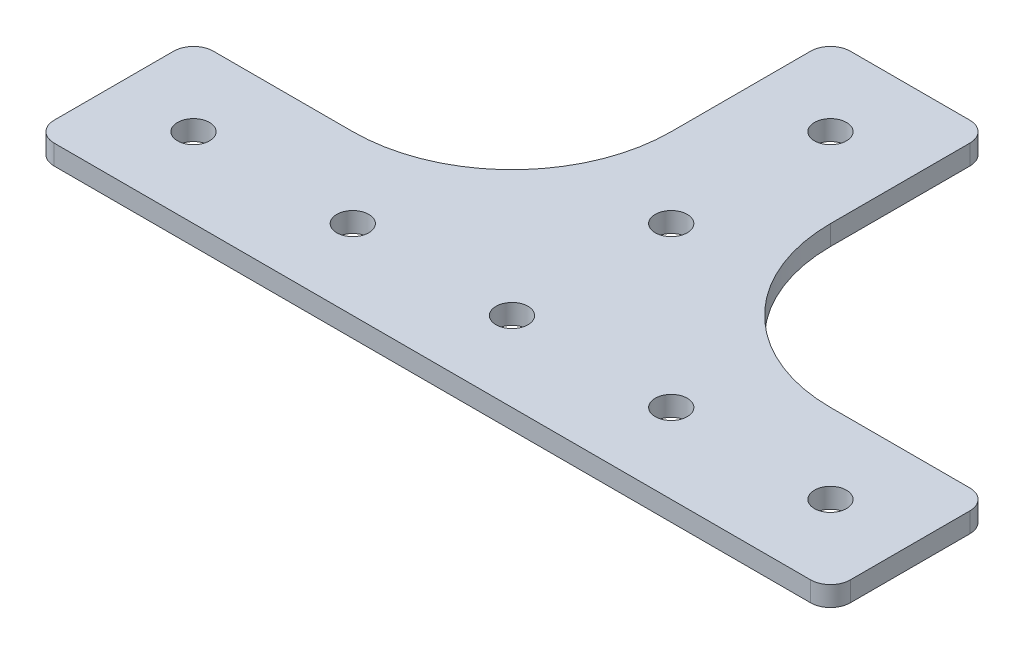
from build123d import *

# Parameters (mm, degrees)
BOSS_EXTRUDE1_DEPTH        = 3.175
F_7_0_201_DIAMETER_HOLE1_D = 5.1054


with BuildPart() as part:
    # Sketch1 → Boss-Extrude1 (new body)
    with BuildSketch(Plane(origin=(0, 0, 0), x_dir=(1, 0, 0), z_dir=(0, 1, 0))):
        with BuildLine():
            Line((-60.325, 0), (60.325, 0))
            ThreePointArc((60.325, 0), (62.57006403, 0.92993597), (63.5, 3.175))
            Line((63.5, 3.175), (63.5, 22.225))
            ThreePointArc((63.5, 22.225), (62.57006403, 24.47006403), (60.325, 25.4))
            Line((60.325, 25.4), (38.1, 25.4))
            ThreePointArc((38.1, 25.4), (20.139487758, 32.839487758), (12.7, 50.8))
            Line((12.7, 50.8), (12.7, 73.025))
            ThreePointArc((12.7, 73.025), (11.77006403, 75.27006403), (9.525, 76.2))
            Line((9.525, 76.2), (-9.525, 76.2))
            ThreePointArc((-9.525, 76.2), (-11.77006403, 75.27006403), (-12.7, 73.025))
            Line((-12.7, 73.025), (-12.7, 50.8))
            ThreePointArc((-12.7, 50.8), (-20.139487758, 32.839487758), (-38.1, 25.4))
            Line((-38.1, 25.4), (-60.325, 25.4))
            ThreePointArc((-60.325, 25.4), (-62.57006403, 24.47006403), (-63.5, 22.225))
            Line((-63.5, 22.225), (-63.5, 3.175))
            ThreePointArc((-63.5, 3.175), (-62.57006403, 0.92993597), (-60.325, 0))
        make_face()
    extrude(amount=BOSS_EXTRUDE1_DEPTH)

    # 7 _0.201_ Diameter Hole1 (through all)
    with Locations(Plane(origin=(0, 3.175, 0), x_dir=(1, 0, 0), z_dir=(0, 1, 0))):
        with Locations((-50.8, 12.7), (-25.4, 12.7), (0, 12.7), (25.4, 12.7), (50.8, 12.7), (0, 38.1), (0, 63.5)):
            Hole(F_7_0_201_DIAMETER_HOLE1_D / 2)


solid = part.part
